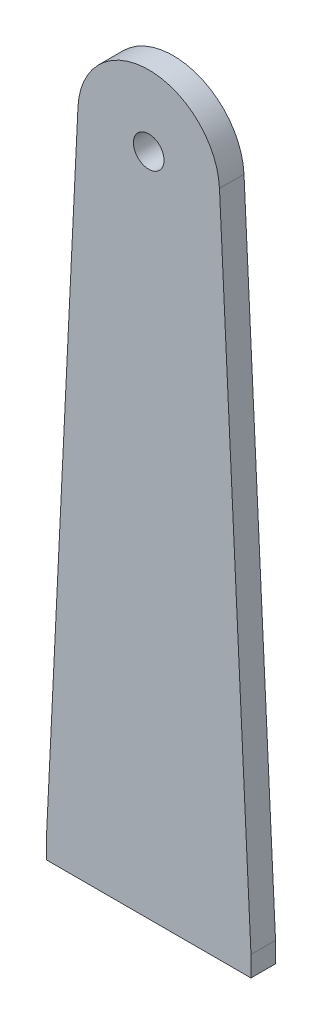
ISO-10303-21;
HEADER;
FILE_DESCRIPTION(('STEP AP214'),'2;1');
FILE_NAME('part.step','',(''),(''),'','','');
FILE_SCHEMA(('AUTOMOTIVE_DESIGN { 1 0 10303 214 1 1 1 1 }'));
ENDSEC;
DATA;
#1=APPLICATION_CONTEXT('core data for automotive mechanical design processes');
#2=APPLICATION_PROTOCOL_DEFINITION('international standard','automotive_design',2000,#1);
#3=PRODUCT_CONTEXT('',#1,'mechanical');
#4=PRODUCT('Part','Part','',(#3));
#5=PRODUCT_RELATED_PRODUCT_CATEGORY('part','',(#4));
#6=PRODUCT_DEFINITION_FORMATION('','',#4);
#7=PRODUCT_DEFINITION_CONTEXT('part definition',#1,'design');
#8=PRODUCT_DEFINITION('design','',#6,#7);
#9=PRODUCT_DEFINITION_SHAPE('','',#8);
#10=(LENGTH_UNIT() NAMED_UNIT(*) SI_UNIT(.MILLI.,.METRE.));
#11=(NAMED_UNIT(*) PLANE_ANGLE_UNIT() SI_UNIT($,.RADIAN.));
#12=(NAMED_UNIT(*) SI_UNIT($,.STERADIAN.) SOLID_ANGLE_UNIT());
#13=UNCERTAINTY_MEASURE_WITH_UNIT(LENGTH_MEASURE(1.E-05),#10,'distance_accuracy_value','');
#14=(GEOMETRIC_REPRESENTATION_CONTEXT(3) GLOBAL_UNCERTAINTY_ASSIGNED_CONTEXT((#13)) GLOBAL_UNIT_ASSIGNED_CONTEXT((#10,
#11,#12)) REPRESENTATION_CONTEXT('',''));
#15=CARTESIAN_POINT('',(0.,0.,0.));
#16=DIRECTION('',(0.,0.,1.));
#17=DIRECTION('',(1.,0.,0.));
#18=AXIS2_PLACEMENT_3D('',#15,#16,#17);
#19=CARTESIAN_POINT('',(0.,325.,39.));
#20=DIRECTION('',(0.,0.,1.));
#21=DIRECTION('',(1.,0.,0.));
#22=AXIS2_PLACEMENT_3D('',#19,#20,#21);
#23=PLANE('',#22);
#24=CARTESIAN_POINT('',(0.,325.,39.));
#25=DIRECTION('',(0.,0.,1.));
#26=DIRECTION('',(1.,0.,0.));
#27=AXIS2_PLACEMENT_3D('',#24,#25,#26);
#28=CIRCLE('',#27,34.6352873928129);
#29=CARTESIAN_POINT('',(34.594377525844,326.682907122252,39.));
#30=VERTEX_POINT('',#29);
#31=CARTESIAN_POINT('',(-34.594377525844,326.682907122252,39.));
#32=VERTEX_POINT('',#31);
#33=EDGE_CURVE('E91',#30,#32,#28,.T.);
#34=ORIENTED_EDGE('',*,*,#33,.T.);
#35=DIRECTION('',(-0.0485893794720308,-0.998818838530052,0.));
#36=VECTOR('',#35,1.);
#37=CARTESIAN_POINT('',(-50.,10.,39.));
#38=LINE('',#37,#36);
#39=CARTESIAN_POINT('',(-50.,10.,39.));
#40=VERTEX_POINT('',#39);
#41=EDGE_CURVE('E148',#32,#40,#38,.T.);
#42=ORIENTED_EDGE('',*,*,#41,.T.);
#43=DIRECTION('',(0.,-1.,0.));
#44=VECTOR('',#43,1.);
#45=CARTESIAN_POINT('',(-50.,0.,39.));
#46=LINE('',#45,#44);
#47=CARTESIAN_POINT('',(-50.,0.,39.));
#48=VERTEX_POINT('',#47);
#49=EDGE_CURVE('E105',#40,#48,#46,.T.);
#50=ORIENTED_EDGE('',*,*,#49,.T.);
#51=DIRECTION('',(1.,0.,0.));
#52=VECTOR('',#51,1.);
#53=CARTESIAN_POINT('',(50.,0.,39.));
#54=LINE('',#53,#52);
#55=CARTESIAN_POINT('',(50.,0.,39.));
#56=VERTEX_POINT('',#55);
#57=EDGE_CURVE('E99',#48,#56,#54,.T.);
#58=ORIENTED_EDGE('',*,*,#57,.T.);
#59=DIRECTION('',(0.,1.,0.));
#60=VECTOR('',#59,1.);
#61=CARTESIAN_POINT('',(50.,0.,39.));
#62=LINE('',#61,#60);
#63=CARTESIAN_POINT('',(50.,10.,39.));
#64=VERTEX_POINT('',#63);
#65=EDGE_CURVE('E103',#56,#64,#62,.T.);
#66=ORIENTED_EDGE('',*,*,#65,.T.);
#67=DIRECTION('',(-0.0485893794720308,0.998818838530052,0.));
#68=VECTOR('',#67,1.);
#69=CARTESIAN_POINT('',(50.,10.,39.));
#70=LINE('',#69,#68);
#71=EDGE_CURVE('E55',#64,#30,#70,.T.);
#72=ORIENTED_EDGE('',*,*,#71,.T.);
#73=EDGE_LOOP('',(#34,#42,#50,#58,#66,#72));
#74=FACE_BOUND('',#73,.T.);
#75=CARTESIAN_POINT('',(0.,325.,39.));
#76=DIRECTION('',(0.,0.,1.));
#77=DIRECTION('',(1.,0.,0.));
#78=AXIS2_PLACEMENT_3D('',#75,#76,#77);
#79=CIRCLE('',#78,7.50000000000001);
#80=CARTESIAN_POINT('',(7.50000000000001,325.,39.));
#81=VERTEX_POINT('',#80);
#82=EDGE_CURVE('E125',#81,#81,#79,.T.);
#83=ORIENTED_EDGE('',*,*,#82,.F.);
#84=EDGE_LOOP('',(#83));
#85=FACE_BOUND('',#84,.T.);
#86=ADVANCED_FACE('F38',(#74,#85),#23,.T.);
#87=CARTESIAN_POINT('',(0.,325.,27.));
#88=DIRECTION('',(0.,0.,1.));
#89=DIRECTION('',(1.,0.,0.));
#90=AXIS2_PLACEMENT_3D('',#87,#88,#89);
#91=PLANE('',#90);
#92=CARTESIAN_POINT('',(0.,325.,27.));
#93=DIRECTION('',(0.,0.,1.));
#94=DIRECTION('',(-1.,0.,0.));
#95=AXIS2_PLACEMENT_3D('',#92,#93,#94);
#96=CIRCLE('',#95,34.6352873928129);
#97=CARTESIAN_POINT('',(34.594377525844,326.682907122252,27.));
#98=VERTEX_POINT('',#97);
#99=CARTESIAN_POINT('',(-34.594377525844,326.682907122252,27.));
#100=VERTEX_POINT('',#99);
#101=EDGE_CURVE('E85',#98,#100,#96,.T.);
#102=ORIENTED_EDGE('',*,*,#101,.F.);
#103=DIRECTION('',(-0.0485893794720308,0.998818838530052,0.));
#104=VECTOR('',#103,1.);
#105=CARTESIAN_POINT('',(50.,10.,27.));
#106=LINE('',#105,#104);
#107=CARTESIAN_POINT('',(50.,10.,27.));
#108=VERTEX_POINT('',#107);
#109=EDGE_CURVE('E131',#108,#98,#106,.T.);
#110=ORIENTED_EDGE('',*,*,#109,.F.);
#111=DIRECTION('',(0.,1.,0.));
#112=VECTOR('',#111,1.);
#113=CARTESIAN_POINT('',(50.,0.,27.));
#114=LINE('',#113,#112);
#115=CARTESIAN_POINT('',(50.,0.,27.));
#116=VERTEX_POINT('',#115);
#117=EDGE_CURVE('E78',#116,#108,#114,.T.);
#118=ORIENTED_EDGE('',*,*,#117,.F.);
#119=DIRECTION('',(1.,0.,0.));
#120=VECTOR('',#119,1.);
#121=CARTESIAN_POINT('',(50.,0.,27.));
#122=LINE('',#121,#120);
#123=CARTESIAN_POINT('',(-50.,0.,27.));
#124=VERTEX_POINT('',#123);
#125=EDGE_CURVE('E113',#124,#116,#122,.T.);
#126=ORIENTED_EDGE('',*,*,#125,.F.);
#127=DIRECTION('',(0.,-1.,0.));
#128=VECTOR('',#127,1.);
#129=CARTESIAN_POINT('',(-50.,0.,27.));
#130=LINE('',#129,#128);
#131=CARTESIAN_POINT('',(-50.,10.,27.));
#132=VERTEX_POINT('',#131);
#133=EDGE_CURVE('E127',#132,#124,#130,.T.);
#134=ORIENTED_EDGE('',*,*,#133,.F.);
#135=DIRECTION('',(-0.0485893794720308,-0.998818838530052,0.));
#136=VECTOR('',#135,1.);
#137=CARTESIAN_POINT('',(-50.,10.,27.));
#138=LINE('',#137,#136);
#139=EDGE_CURVE('E124',#100,#132,#138,.T.);
#140=ORIENTED_EDGE('',*,*,#139,.F.);
#141=EDGE_LOOP('',(#102,#110,#118,#126,#134,#140));
#142=FACE_BOUND('',#141,.T.);
#143=CARTESIAN_POINT('',(0.,325.,27.));
#144=DIRECTION('',(0.,0.,1.));
#145=DIRECTION('',(1.,0.,0.));
#146=AXIS2_PLACEMENT_3D('',#143,#144,#145);
#147=CIRCLE('',#146,7.50000000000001);
#148=CARTESIAN_POINT('',(7.50000000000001,325.,27.));
#149=VERTEX_POINT('',#148);
#150=EDGE_CURVE('E152',#149,#149,#147,.T.);
#151=ORIENTED_EDGE('',*,*,#150,.T.);
#152=EDGE_LOOP('',(#151));
#153=FACE_BOUND('',#152,.T.);
#154=ADVANCED_FACE('F143',(#142,#153),#91,.F.);
#155=CARTESIAN_POINT('',(0.,325.,39.));
#156=DIRECTION('',(0.,0.,-1.));
#157=DIRECTION('',(-1.,0.,0.));
#158=AXIS2_PLACEMENT_3D('',#155,#156,#157);
#159=CYLINDRICAL_SURFACE('',#158,34.6352873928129);
#160=ORIENTED_EDGE('',*,*,#101,.T.);
#161=DIRECTION('',(0.,0.,-1.));
#162=VECTOR('',#161,1.);
#163=CARTESIAN_POINT('',(-34.594377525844,326.682907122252,39.));
#164=LINE('',#163,#162);
#165=EDGE_CURVE('E11',#32,#100,#164,.T.);
#166=ORIENTED_EDGE('',*,*,#165,.F.);
#167=ORIENTED_EDGE('',*,*,#33,.F.);
#168=DIRECTION('',(0.,0.,-1.));
#169=VECTOR('',#168,1.);
#170=CARTESIAN_POINT('',(34.594377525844,326.682907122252,39.));
#171=LINE('',#170,#169);
#172=EDGE_CURVE('E119',#30,#98,#171,.T.);
#173=ORIENTED_EDGE('',*,*,#172,.T.);
#174=EDGE_LOOP('',(#160,#166,#167,#173));
#175=FACE_BOUND('',#174,.T.);
#176=ADVANCED_FACE('F40',(#175),#159,.T.);
#177=CARTESIAN_POINT('',(-50.,10.,39.));
#178=DIRECTION('',(0.998818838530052,-0.0485893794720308,0.));
#179=DIRECTION('',(0.0485893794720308,0.998818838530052,0.));
#180=AXIS2_PLACEMENT_3D('',#177,#178,#179);
#181=PLANE('',#180);
#182=ORIENTED_EDGE('',*,*,#139,.T.);
#183=DIRECTION('',(0.,0.,-1.));
#184=VECTOR('',#183,1.);
#185=CARTESIAN_POINT('',(-50.,10.,39.));
#186=LINE('',#185,#184);
#187=EDGE_CURVE('E47',#40,#132,#186,.T.);
#188=ORIENTED_EDGE('',*,*,#187,.F.);
#189=ORIENTED_EDGE('',*,*,#41,.F.);
#190=ORIENTED_EDGE('',*,*,#165,.T.);
#191=EDGE_LOOP('',(#182,#188,#189,#190));
#192=FACE_BOUND('',#191,.T.);
#193=ADVANCED_FACE('F175',(#192),#181,.F.);
#194=CARTESIAN_POINT('',(-50.,0.,39.));
#195=DIRECTION('',(1.,0.,0.));
#196=DIRECTION('',(0.,0.,-1.));
#197=AXIS2_PLACEMENT_3D('',#194,#195,#196);
#198=PLANE('',#197);
#199=ORIENTED_EDGE('',*,*,#133,.T.);
#200=DIRECTION('',(0.,0.,-1.));
#201=VECTOR('',#200,1.);
#202=CARTESIAN_POINT('',(-50.,0.,39.));
#203=LINE('',#202,#201);
#204=EDGE_CURVE('E114',#48,#124,#203,.T.);
#205=ORIENTED_EDGE('',*,*,#204,.F.);
#206=ORIENTED_EDGE('',*,*,#49,.F.);
#207=ORIENTED_EDGE('',*,*,#187,.T.);
#208=EDGE_LOOP('',(#199,#205,#206,#207));
#209=FACE_BOUND('',#208,.T.);
#210=ADVANCED_FACE('F140',(#209),#198,.F.);
#211=CARTESIAN_POINT('',(50.,0.,39.));
#212=DIRECTION('',(0.,1.,0.));
#213=DIRECTION('',(0.,0.,1.));
#214=AXIS2_PLACEMENT_3D('',#211,#212,#213);
#215=PLANE('',#214);
#216=ORIENTED_EDGE('',*,*,#125,.T.);
#217=DIRECTION('',(0.,0.,-1.));
#218=VECTOR('',#217,1.);
#219=CARTESIAN_POINT('',(50.,0.,39.));
#220=LINE('',#219,#218);
#221=EDGE_CURVE('E110',#56,#116,#220,.T.);
#222=ORIENTED_EDGE('',*,*,#221,.F.);
#223=ORIENTED_EDGE('',*,*,#57,.F.);
#224=ORIENTED_EDGE('',*,*,#204,.T.);
#225=EDGE_LOOP('',(#216,#222,#223,#224));
#226=FACE_BOUND('',#225,.T.);
#227=ADVANCED_FACE('F111',(#226),#215,.F.);
#228=CARTESIAN_POINT('',(50.,0.,39.));
#229=DIRECTION('',(-1.,0.,0.));
#230=DIRECTION('',(0.,0.,1.));
#231=AXIS2_PLACEMENT_3D('',#228,#229,#230);
#232=PLANE('',#231);
#233=ORIENTED_EDGE('',*,*,#117,.T.);
#234=DIRECTION('',(0.,0.,-1.));
#235=VECTOR('',#234,1.);
#236=CARTESIAN_POINT('',(50.,10.,39.));
#237=LINE('',#236,#235);
#238=EDGE_CURVE('E115',#64,#108,#237,.T.);
#239=ORIENTED_EDGE('',*,*,#238,.F.);
#240=ORIENTED_EDGE('',*,*,#65,.F.);
#241=ORIENTED_EDGE('',*,*,#221,.T.);
#242=EDGE_LOOP('',(#233,#239,#240,#241));
#243=FACE_BOUND('',#242,.T.);
#244=ADVANCED_FACE('F117',(#243),#232,.F.);
#245=CARTESIAN_POINT('',(50.,10.,39.));
#246=DIRECTION('',(-0.998818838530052,-0.0485893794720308,0.));
#247=DIRECTION('',(0.0485893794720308,-0.998818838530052,0.));
#248=AXIS2_PLACEMENT_3D('',#245,#246,#247);
#249=PLANE('',#248);
#250=ORIENTED_EDGE('',*,*,#109,.T.);
#251=ORIENTED_EDGE('',*,*,#172,.F.);
#252=ORIENTED_EDGE('',*,*,#71,.F.);
#253=ORIENTED_EDGE('',*,*,#238,.T.);
#254=EDGE_LOOP('',(#250,#251,#252,#253));
#255=FACE_BOUND('',#254,.T.);
#256=ADVANCED_FACE('F146',(#255),#249,.F.);
#257=CARTESIAN_POINT('',(0.,325.,39.));
#258=DIRECTION('',(0.,0.,-1.));
#259=DIRECTION('',(-1.,0.,0.));
#260=AXIS2_PLACEMENT_3D('',#257,#258,#259);
#261=CYLINDRICAL_SURFACE('',#260,7.50000000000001);
#262=ORIENTED_EDGE('',*,*,#82,.T.);
#263=EDGE_LOOP('',(#262));
#264=FACE_BOUND('',#263,.T.);
#265=ORIENTED_EDGE('',*,*,#150,.F.);
#266=EDGE_LOOP('',(#265));
#267=FACE_BOUND('',#266,.T.);
#268=ADVANCED_FACE('F158',(#264,#267),#261,.F.);
#269=CLOSED_SHELL('',(#86,#154,#176,#193,#210,#227,#244,#256,#268));
#270=MANIFOLD_SOLID_BREP('B2',#269);
#271=ADVANCED_BREP_SHAPE_REPRESENTATION('',(#18,#270),#14);
#272=SHAPE_DEFINITION_REPRESENTATION(#9,#271);
ENDSEC;
END-ISO-10303-21;
